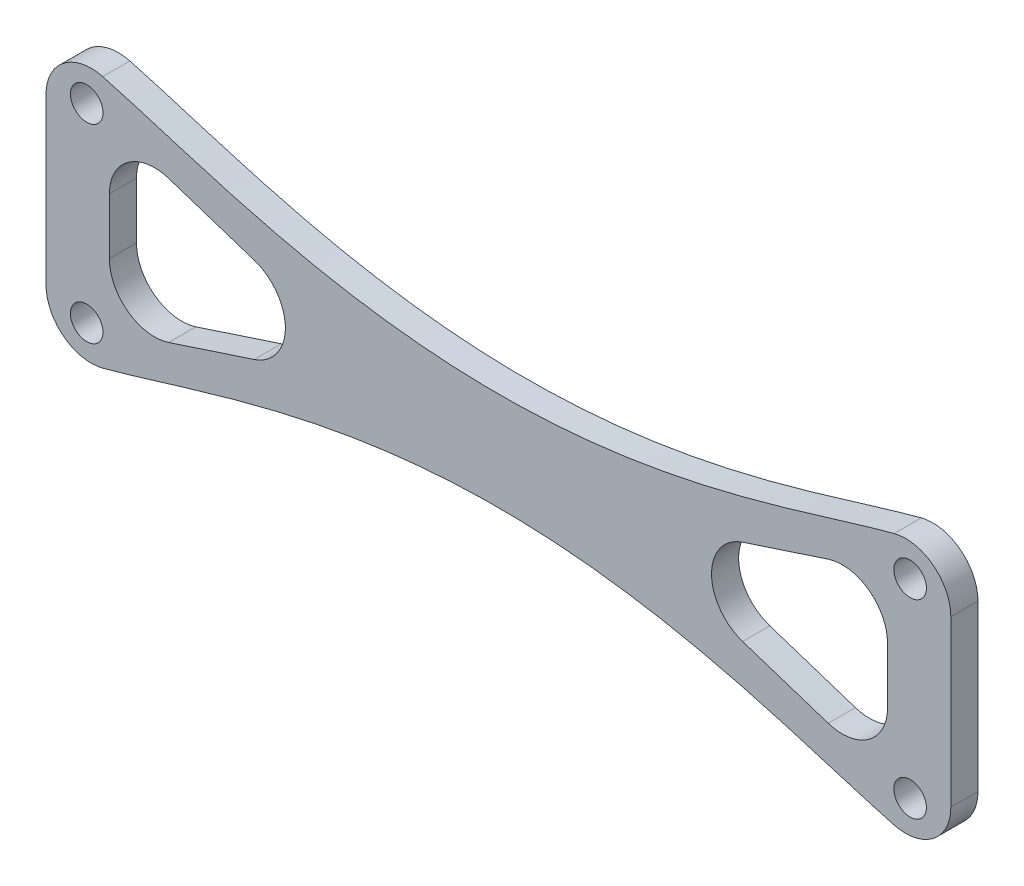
ISO-10303-21;
HEADER;
FILE_DESCRIPTION(('STEP AP214'),'2;1');
FILE_NAME('part.step','',(''),(''),'','','');
FILE_SCHEMA(('AUTOMOTIVE_DESIGN { 1 0 10303 214 1 1 1 1 }'));
ENDSEC;
DATA;
#1=APPLICATION_CONTEXT('core data for automotive mechanical design processes');
#2=APPLICATION_PROTOCOL_DEFINITION('international standard','automotive_design',2000,#1);
#3=PRODUCT_CONTEXT('',#1,'mechanical');
#4=PRODUCT('Part','Part','',(#3));
#5=PRODUCT_RELATED_PRODUCT_CATEGORY('part','',(#4));
#6=PRODUCT_DEFINITION_FORMATION('','',#4);
#7=PRODUCT_DEFINITION_CONTEXT('part definition',#1,'design');
#8=PRODUCT_DEFINITION('design','',#6,#7);
#9=PRODUCT_DEFINITION_SHAPE('','',#8);
#10=(LENGTH_UNIT() NAMED_UNIT(*) SI_UNIT(.MILLI.,.METRE.));
#11=(NAMED_UNIT(*) PLANE_ANGLE_UNIT() SI_UNIT($,.RADIAN.));
#12=(NAMED_UNIT(*) SI_UNIT($,.STERADIAN.) SOLID_ANGLE_UNIT());
#13=UNCERTAINTY_MEASURE_WITH_UNIT(LENGTH_MEASURE(1.E-05),#10,'distance_accuracy_value','');
#14=(GEOMETRIC_REPRESENTATION_CONTEXT(3) GLOBAL_UNCERTAINTY_ASSIGNED_CONTEXT((#13)) GLOBAL_UNIT_ASSIGNED_CONTEXT((#10,
#11,#12)) REPRESENTATION_CONTEXT('',''));
#15=CARTESIAN_POINT('',(0.,0.,0.));
#16=DIRECTION('',(0.,0.,1.));
#17=DIRECTION('',(1.,0.,0.));
#18=AXIS2_PLACEMENT_3D('',#15,#16,#17);
#19=CARTESIAN_POINT('',(-100.,0.,3.));
#20=DIRECTION('',(-1.,0.,0.));
#21=DIRECTION('',(0.,0.,1.));
#22=AXIS2_PLACEMENT_3D('',#19,#20,#21);
#23=PLANE('',#22);
#24=DIRECTION('',(0.,1.,0.));
#25=VECTOR('',#24,1.);
#26=CARTESIAN_POINT('',(-100.,0.,3.));
#27=LINE('',#26,#25);
#28=CARTESIAN_POINT('',(-100.,5.88603798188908,3.));
#29=VERTEX_POINT('',#28);
#30=CARTESIAN_POINT('',(-100.,24.1139620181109,3.));
#31=VERTEX_POINT('',#30);
#32=EDGE_CURVE('E417',#29,#31,#27,.T.);
#33=ORIENTED_EDGE('',*,*,#32,.T.);
#34=DIRECTION('',(0.,0.,-1.));
#35=VECTOR('',#34,1.);
#36=CARTESIAN_POINT('',(-100.,24.1139620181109,3.));
#37=LINE('',#36,#35);
#38=CARTESIAN_POINT('',(-100.,24.1139620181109,0.));
#39=VERTEX_POINT('',#38);
#40=EDGE_CURVE('E291',#31,#39,#37,.T.);
#41=ORIENTED_EDGE('',*,*,#40,.T.);
#42=DIRECTION('',(0.,1.,0.));
#43=VECTOR('',#42,1.);
#44=CARTESIAN_POINT('',(-100.,0.,0.));
#45=LINE('',#44,#43);
#46=CARTESIAN_POINT('',(-100.,5.88603798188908,0.));
#47=VERTEX_POINT('',#46);
#48=EDGE_CURVE('E221',#47,#39,#45,.T.);
#49=ORIENTED_EDGE('',*,*,#48,.F.);
#50=DIRECTION('',(0.,0.,1.));
#51=VECTOR('',#50,1.);
#52=CARTESIAN_POINT('',(-100.,5.88603798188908,3.));
#53=LINE('',#52,#51);
#54=EDGE_CURVE('E288',#47,#29,#53,.T.);
#55=ORIENTED_EDGE('',*,*,#54,.T.);
#56=EDGE_LOOP('',(#33,#41,#49,#55));
#57=FACE_BOUND('',#56,.T.);
#58=ADVANCED_FACE('F45',(#57),#23,.T.);
#59=CARTESIAN_POINT('',(-100.,0.,3.));
#60=CARTESIAN_POINT('',(-85.5,0.,3.));
#61=CARTESIAN_POINT('',(-50.,25.5,3.));
#62=CARTESIAN_POINT('',(-14.5,0.,3.));
#63=CARTESIAN_POINT('',(0.,0.,3.));
#64=B_SPLINE_CURVE_WITH_KNOTS('',4,(#59,#60,#61,#62,#63),.UNSPECIFIED.,.F.,.F.,(5,5),(0.,1.),.UNSPECIFIED.);
#65=DIRECTION('',(0.,0.,-1.));
#66=VECTOR('',#65,1.);
#67=SURFACE_OF_LINEAR_EXTRUSION('',#64,#66);
#68=CARTESIAN_POINT('',(-93.7291000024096,1.05025333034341,3.));
#69=VERTEX_POINT('',#68);
#70=CARTESIAN_POINT('',(-6.27089999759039,1.0502533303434,3.));
#71=VERTEX_POINT('',#70);
#72=EDGE_CURVE('E421',#69,#71,#64,.T.);
#73=ORIENTED_EDGE('',*,*,#72,.F.);
#74=DIRECTION('',(0.,0.,-1.));
#75=VECTOR('',#74,1.);
#76=CARTESIAN_POINT('',(-93.7291000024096,1.05025333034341,3.));
#77=LINE('',#76,#75);
#78=CARTESIAN_POINT('',(-93.7291000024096,1.05025333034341,0.));
#79=VERTEX_POINT('',#78);
#80=EDGE_CURVE('E328',#69,#79,#77,.T.);
#81=ORIENTED_EDGE('',*,*,#80,.T.);
#82=CARTESIAN_POINT('',(-100.,0.,0.));
#83=CARTESIAN_POINT('',(-85.5,0.,0.));
#84=CARTESIAN_POINT('',(-50.,25.5,0.));
#85=CARTESIAN_POINT('',(-14.5,0.,0.));
#86=CARTESIAN_POINT('',(0.,0.,0.));
#87=B_SPLINE_CURVE_WITH_KNOTS('',4,(#82,#83,#84,#85,#86),.UNSPECIFIED.,.F.,.F.,(5,5),(0.,1.),.UNSPECIFIED.);
#88=CARTESIAN_POINT('',(-6.27089999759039,1.0502533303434,0.));
#89=VERTEX_POINT('',#88);
#90=EDGE_CURVE('E230',#79,#89,#87,.T.);
#91=ORIENTED_EDGE('',*,*,#90,.T.);
#92=DIRECTION('',(0.,0.,-1.));
#93=VECTOR('',#92,1.);
#94=CARTESIAN_POINT('',(-6.27089999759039,1.0502533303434,0.));
#95=LINE('',#94,#93);
#96=EDGE_CURVE('E325',#89,#71,#95,.F.);
#97=ORIENTED_EDGE('',*,*,#96,.T.);
#98=EDGE_LOOP('',(#73,#81,#91,#97));
#99=FACE_BOUND('',#98,.T.);
#100=ADVANCED_FACE('F433',(#99),#67,.F.);
#101=CARTESIAN_POINT('',(0.,0.,3.));
#102=DIRECTION('',(-1.,0.,0.));
#103=DIRECTION('',(0.,0.,1.));
#104=AXIS2_PLACEMENT_3D('',#101,#102,#103);
#105=PLANE('',#104);
#106=DIRECTION('',(0.,1.,0.));
#107=VECTOR('',#106,1.);
#108=CARTESIAN_POINT('',(0.,0.,3.));
#109=LINE('',#108,#107);
#110=CARTESIAN_POINT('',(0.,5.88603798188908,3.));
#111=VERTEX_POINT('',#110);
#112=CARTESIAN_POINT('',(0.,24.1139620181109,3.));
#113=VERTEX_POINT('',#112);
#114=EDGE_CURVE('E427',#111,#113,#109,.T.);
#115=ORIENTED_EDGE('',*,*,#114,.F.);
#116=DIRECTION('',(0.,0.,-1.));
#117=VECTOR('',#116,1.);
#118=CARTESIAN_POINT('',(0.,5.88603798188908,3.));
#119=LINE('',#118,#117);
#120=CARTESIAN_POINT('',(0.,5.88603798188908,0.));
#121=VERTEX_POINT('',#120);
#122=EDGE_CURVE('E196',#111,#121,#119,.T.);
#123=ORIENTED_EDGE('',*,*,#122,.T.);
#124=DIRECTION('',(0.,1.,0.));
#125=VECTOR('',#124,1.);
#126=CARTESIAN_POINT('',(0.,0.,0.));
#127=LINE('',#126,#125);
#128=CARTESIAN_POINT('',(0.,24.1139620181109,0.));
#129=VERTEX_POINT('',#128);
#130=EDGE_CURVE('E236',#121,#129,#127,.T.);
#131=ORIENTED_EDGE('',*,*,#130,.T.);
#132=DIRECTION('',(0.,0.,1.));
#133=VECTOR('',#132,1.);
#134=CARTESIAN_POINT('',(0.,24.1139620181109,3.));
#135=LINE('',#134,#133);
#136=EDGE_CURVE('E61',#129,#113,#135,.T.);
#137=ORIENTED_EDGE('',*,*,#136,.T.);
#138=EDGE_LOOP('',(#115,#123,#131,#137));
#139=FACE_BOUND('',#138,.T.);
#140=ADVANCED_FACE('F437',(#139),#105,.F.);
#141=CARTESIAN_POINT('',(-7.,0.,3.));
#142=DIRECTION('',(1.,0.,0.));
#143=DIRECTION('',(0.,0.,-1.));
#144=AXIS2_PLACEMENT_3D('',#141,#142,#143);
#145=PLANE('',#144);
#146=DIRECTION('',(0.,-1.,0.));
#147=VECTOR('',#146,1.);
#148=CARTESIAN_POINT('',(-7.,0.,0.));
#149=LINE('',#148,#147);
#150=CARTESIAN_POINT('',(-7.,18.0987692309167,0.));
#151=VERTEX_POINT('',#150);
#152=CARTESIAN_POINT('',(-7.,11.9012307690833,0.));
#153=VERTEX_POINT('',#152);
#154=EDGE_CURVE('E216',#151,#153,#149,.T.);
#155=ORIENTED_EDGE('',*,*,#154,.T.);
#156=DIRECTION('',(0.,0.,-1.));
#157=VECTOR('',#156,1.);
#158=CARTESIAN_POINT('',(-7.,11.9012307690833,3.));
#159=LINE('',#158,#157);
#160=CARTESIAN_POINT('',(-7.,11.9012307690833,3.));
#161=VERTEX_POINT('',#160);
#162=EDGE_CURVE('E189',#153,#161,#159,.F.);
#163=ORIENTED_EDGE('',*,*,#162,.T.);
#164=DIRECTION('',(0.,-1.,0.));
#165=VECTOR('',#164,1.);
#166=CARTESIAN_POINT('',(-7.,0.,3.));
#167=LINE('',#166,#165);
#168=CARTESIAN_POINT('',(-7.,18.0987692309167,3.));
#169=VERTEX_POINT('',#168);
#170=EDGE_CURVE('E407',#169,#161,#167,.T.);
#171=ORIENTED_EDGE('',*,*,#170,.F.);
#172=DIRECTION('',(0.,0.,-1.));
#173=VECTOR('',#172,1.);
#174=CARTESIAN_POINT('',(-7.,18.0987692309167,0.));
#175=LINE('',#174,#173);
#176=EDGE_CURVE('E207',#169,#151,#175,.T.);
#177=ORIENTED_EDGE('',*,*,#176,.T.);
#178=EDGE_LOOP('',(#155,#163,#171,#177));
#179=FACE_BOUND('',#178,.T.);
#180=ADVANCED_FACE('F450',(#179),#145,.F.);
#181=CARTESIAN_POINT('',(0.80077651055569,2.44236835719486,3.));
#182=DIRECTION('',(-0.311550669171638,-0.950229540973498,0.));
#183=DIRECTION('',(0.950229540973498,-0.311550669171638,0.));
#184=AXIS2_PLACEMENT_3D('',#181,#182,#183);
#185=PLANE('',#184);
#186=DIRECTION('',(-0.950229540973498,0.311550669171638,0.));
#187=VECTOR('',#186,1.);
#188=CARTESIAN_POINT('',(0.80077651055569,2.44236835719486,3.));
#189=LINE('',#188,#187);
#190=CARTESIAN_POINT('',(-13.5577533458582,7.1500830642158,3.));
#191=VERTEX_POINT('',#190);
#192=CARTESIAN_POINT('',(-23.0089995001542,10.2488522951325,3.));
#193=VERTEX_POINT('',#192);
#194=EDGE_CURVE('E205',#191,#193,#189,.T.);
#195=ORIENTED_EDGE('',*,*,#194,.F.);
#196=DIRECTION('',(0.,0.,-1.));
#197=VECTOR('',#196,1.);
#198=CARTESIAN_POINT('',(-13.5577533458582,7.1500830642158,0.));
#199=LINE('',#198,#197);
#200=CARTESIAN_POINT('',(-13.5577533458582,7.1500830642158,0.));
#201=VERTEX_POINT('',#200);
#202=EDGE_CURVE('E188',#191,#201,#199,.T.);
#203=ORIENTED_EDGE('',*,*,#202,.T.);
#204=DIRECTION('',(-0.950229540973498,0.311550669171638,0.));
#205=VECTOR('',#204,1.);
#206=CARTESIAN_POINT('',(0.80077651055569,2.44236835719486,0.));
#207=LINE('',#206,#205);
#208=CARTESIAN_POINT('',(-23.0089995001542,10.2488522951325,0.));
#209=VERTEX_POINT('',#208);
#210=EDGE_CURVE('E202',#201,#209,#207,.T.);
#211=ORIENTED_EDGE('',*,*,#210,.T.);
#212=DIRECTION('',(0.,0.,-1.));
#213=VECTOR('',#212,1.);
#214=CARTESIAN_POINT('',(-23.0089995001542,10.2488522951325,3.));
#215=LINE('',#214,#213);
#216=EDGE_CURVE('E208',#209,#193,#215,.F.);
#217=ORIENTED_EDGE('',*,*,#216,.T.);
#218=EDGE_LOOP('',(#195,#203,#211,#217));
#219=FACE_BOUND('',#218,.T.);
#220=ADVANCED_FACE('F201',(#219),#185,.F.);
#221=CARTESIAN_POINT('',(-1.6258189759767,-4.95874787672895,3.));
#222=DIRECTION('',(-0.311550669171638,-0.950229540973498,0.));
#223=DIRECTION('',(0.950229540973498,-0.311550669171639,0.));
#224=AXIS2_PLACEMENT_3D('',#221,#222,#223);
#225=PLANE('',#224);
#226=DIRECTION('',(-0.950229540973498,0.311550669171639,0.));
#227=VECTOR('',#226,1.);
#228=CARTESIAN_POINT('',(-1.6258189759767,-4.95874787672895,0.));
#229=LINE('',#228,#227);
#230=CARTESIAN_POINT('',(-76.9910004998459,19.7511477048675,0.));
#231=VERTEX_POINT('',#230);
#232=CARTESIAN_POINT('',(-86.4422466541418,22.8499169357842,0.));
#233=VERTEX_POINT('',#232);
#234=EDGE_CURVE('E368',#231,#233,#229,.T.);
#235=ORIENTED_EDGE('',*,*,#234,.F.);
#236=DIRECTION('',(0.,0.,-1.));
#237=VECTOR('',#236,1.);
#238=CARTESIAN_POINT('',(-76.9910004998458,19.7511477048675,3.));
#239=LINE('',#238,#237);
#240=CARTESIAN_POINT('',(-76.9910004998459,19.7511477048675,3.));
#241=VERTEX_POINT('',#240);
#242=EDGE_CURVE('E278',#231,#241,#239,.F.);
#243=ORIENTED_EDGE('',*,*,#242,.T.);
#244=DIRECTION('',(-0.950229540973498,0.311550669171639,0.));
#245=VECTOR('',#244,1.);
#246=CARTESIAN_POINT('',(-1.6258189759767,-4.95874787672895,3.));
#247=LINE('',#246,#245);
#248=CARTESIAN_POINT('',(-86.4422466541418,22.8499169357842,3.));
#249=VERTEX_POINT('',#248);
#250=EDGE_CURVE('E386',#241,#249,#247,.T.);
#251=ORIENTED_EDGE('',*,*,#250,.T.);
#252=DIRECTION('',(0.,0.,-1.));
#253=VECTOR('',#252,1.);
#254=CARTESIAN_POINT('',(-86.4422466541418,22.8499169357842,0.));
#255=LINE('',#254,#253);
#256=EDGE_CURVE('E274',#249,#233,#255,.T.);
#257=ORIENTED_EDGE('',*,*,#256,.T.);
#258=EDGE_LOOP('',(#235,#243,#251,#257));
#259=FACE_BOUND('',#258,.T.);
#260=ADVANCED_FACE('F390',(#259),#225,.T.);
#261=CARTESIAN_POINT('',(-10.5071584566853,32.0468332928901,3.));
#262=DIRECTION('',(-0.311550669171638,0.950229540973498,0.));
#263=DIRECTION('',(-0.950229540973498,-0.311550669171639,0.));
#264=AXIS2_PLACEMENT_3D('',#261,#262,#263);
#265=PLANE('',#264);
#266=DIRECTION('',(0.950229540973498,0.311550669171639,0.));
#267=VECTOR('',#266,1.);
#268=CARTESIAN_POINT('',(-10.5071584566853,32.0468332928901,3.));
#269=LINE('',#268,#267);
#270=CARTESIAN_POINT('',(-86.4422466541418,7.1500830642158,3.));
#271=VERTEX_POINT('',#270);
#272=CARTESIAN_POINT('',(-76.9910004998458,10.2488522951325,3.));
#273=VERTEX_POINT('',#272);
#274=EDGE_CURVE('E393',#271,#273,#269,.T.);
#275=ORIENTED_EDGE('',*,*,#274,.T.);
#276=DIRECTION('',(0.,0.,-1.));
#277=VECTOR('',#276,1.);
#278=CARTESIAN_POINT('',(-76.9910004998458,10.2488522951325,0.));
#279=LINE('',#278,#277);
#280=CARTESIAN_POINT('',(-76.9910004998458,10.2488522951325,0.));
#281=VERTEX_POINT('',#280);
#282=EDGE_CURVE('E270',#273,#281,#279,.T.);
#283=ORIENTED_EDGE('',*,*,#282,.T.);
#284=DIRECTION('',(0.950229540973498,0.311550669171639,0.));
#285=VECTOR('',#284,1.);
#286=CARTESIAN_POINT('',(-10.5071584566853,32.0468332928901,0.));
#287=LINE('',#286,#285);
#288=CARTESIAN_POINT('',(-86.4422466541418,7.1500830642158,0.));
#289=VERTEX_POINT('',#288);
#290=EDGE_CURVE('E378',#289,#281,#287,.T.);
#291=ORIENTED_EDGE('',*,*,#290,.F.);
#292=DIRECTION('',(0.,0.,-1.));
#293=VECTOR('',#292,1.);
#294=CARTESIAN_POINT('',(-86.4422466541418,7.1500830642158,3.));
#295=LINE('',#294,#293);
#296=EDGE_CURVE('E267',#289,#271,#295,.F.);
#297=ORIENTED_EDGE('',*,*,#296,.T.);
#298=EDGE_LOOP('',(#275,#283,#291,#297));
#299=FACE_BOUND('',#298,.T.);
#300=ADVANCED_FACE('F446',(#299),#265,.T.);
#301=CARTESIAN_POINT('',(-8.08056297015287,24.6457170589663,3.));
#302=DIRECTION('',(-0.311550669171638,0.950229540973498,0.));
#303=DIRECTION('',(-0.950229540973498,-0.311550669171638,0.));
#304=AXIS2_PLACEMENT_3D('',#301,#302,#303);
#305=PLANE('',#304);
#306=DIRECTION('',(0.950229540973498,0.311550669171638,0.));
#307=VECTOR('',#306,1.);
#308=CARTESIAN_POINT('',(-8.08056297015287,24.6457170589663,0.));
#309=LINE('',#308,#307);
#310=CARTESIAN_POINT('',(-23.0089995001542,19.7511477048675,0.));
#311=VERTEX_POINT('',#310);
#312=CARTESIAN_POINT('',(-13.5577533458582,22.8499169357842,0.));
#313=VERTEX_POINT('',#312);
#314=EDGE_CURVE('E215',#311,#313,#309,.T.);
#315=ORIENTED_EDGE('',*,*,#314,.T.);
#316=DIRECTION('',(0.,0.,-1.));
#317=VECTOR('',#316,1.);
#318=CARTESIAN_POINT('',(-13.5577533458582,22.8499169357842,3.));
#319=LINE('',#318,#317);
#320=CARTESIAN_POINT('',(-13.5577533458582,22.8499169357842,3.));
#321=VERTEX_POINT('',#320);
#322=EDGE_CURVE('E264',#313,#321,#319,.F.);
#323=ORIENTED_EDGE('',*,*,#322,.T.);
#324=DIRECTION('',(0.950229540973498,0.311550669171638,0.));
#325=VECTOR('',#324,1.);
#326=CARTESIAN_POINT('',(-8.08056297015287,24.6457170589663,3.));
#327=LINE('',#326,#325);
#328=CARTESIAN_POINT('',(-23.0089995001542,19.7511477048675,3.));
#329=VERTEX_POINT('',#328);
#330=EDGE_CURVE('E413',#329,#321,#327,.T.);
#331=ORIENTED_EDGE('',*,*,#330,.F.);
#332=DIRECTION('',(0.,0.,-1.));
#333=VECTOR('',#332,1.);
#334=CARTESIAN_POINT('',(-23.0089995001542,19.7511477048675,0.));
#335=LINE('',#334,#333);
#336=EDGE_CURVE('E260',#329,#311,#335,.T.);
#337=ORIENTED_EDGE('',*,*,#336,.T.);
#338=EDGE_LOOP('',(#315,#323,#331,#337));
#339=FACE_BOUND('',#338,.T.);
#340=ADVANCED_FACE('F443',(#339),#305,.F.);
#341=CARTESIAN_POINT('',(-93.,0.,3.));
#342=DIRECTION('',(1.,0.,0.));
#343=DIRECTION('',(0.,0.,-1.));
#344=AXIS2_PLACEMENT_3D('',#341,#342,#343);
#345=PLANE('',#344);
#346=DIRECTION('',(0.,-1.,0.));
#347=VECTOR('',#346,1.);
#348=CARTESIAN_POINT('',(-93.,0.,3.));
#349=LINE('',#348,#347);
#350=CARTESIAN_POINT('',(-93.,18.0987692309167,3.));
#351=VERTEX_POINT('',#350);
#352=CARTESIAN_POINT('',(-93.,11.9012307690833,3.));
#353=VERTEX_POINT('',#352);
#354=EDGE_CURVE('E388',#351,#353,#349,.T.);
#355=ORIENTED_EDGE('',*,*,#354,.T.);
#356=DIRECTION('',(0.,0.,-1.));
#357=VECTOR('',#356,1.);
#358=CARTESIAN_POINT('',(-93.,11.9012307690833,0.));
#359=LINE('',#358,#357);
#360=CARTESIAN_POINT('',(-93.,11.9012307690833,0.));
#361=VERTEX_POINT('',#360);
#362=EDGE_CURVE('E284',#353,#361,#359,.T.);
#363=ORIENTED_EDGE('',*,*,#362,.T.);
#364=DIRECTION('',(0.,-1.,0.));
#365=VECTOR('',#364,1.);
#366=CARTESIAN_POINT('',(-93.,0.,0.));
#367=LINE('',#366,#365);
#368=CARTESIAN_POINT('',(-93.,18.0987692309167,0.));
#369=VERTEX_POINT('',#368);
#370=EDGE_CURVE('E223',#369,#361,#367,.T.);
#371=ORIENTED_EDGE('',*,*,#370,.F.);
#372=DIRECTION('',(0.,0.,-1.));
#373=VECTOR('',#372,1.);
#374=CARTESIAN_POINT('',(-93.,18.0987692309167,3.));
#375=LINE('',#374,#373);
#376=EDGE_CURVE('E281',#369,#351,#375,.F.);
#377=ORIENTED_EDGE('',*,*,#376,.T.);
#378=EDGE_LOOP('',(#355,#363,#371,#377));
#379=FACE_BOUND('',#378,.T.);
#380=ADVANCED_FACE('F374',(#379),#345,.T.);
#381=CARTESIAN_POINT('',(-4.5,25.5,3.));
#382=DIRECTION('',(0.,0.,-1.));
#383=DIRECTION('',(-1.,0.,0.));
#384=AXIS2_PLACEMENT_3D('',#381,#382,#383);
#385=CYLINDRICAL_SURFACE('',#384,1.8);
#386=CARTESIAN_POINT('',(-4.5,25.5,3.));
#387=DIRECTION('',(0.,0.,1.));
#388=DIRECTION('',(1.,0.,0.));
#389=AXIS2_PLACEMENT_3D('',#386,#387,#388);
#390=CIRCLE('',#389,1.8);
#391=CARTESIAN_POINT('',(-2.7,25.5,3.));
#392=VERTEX_POINT('',#391);
#393=EDGE_CURVE('E394',#392,#392,#390,.T.);
#394=ORIENTED_EDGE('',*,*,#393,.T.);
#395=EDGE_LOOP('',(#394));
#396=FACE_BOUND('',#395,.T.);
#397=CARTESIAN_POINT('',(-4.5,25.5,0.));
#398=DIRECTION('',(0.,0.,1.));
#399=DIRECTION('',(1.,0.,0.));
#400=AXIS2_PLACEMENT_3D('',#397,#398,#399);
#401=CIRCLE('',#400,1.8);
#402=CARTESIAN_POINT('',(-2.7,25.5,0.));
#403=VERTEX_POINT('',#402);
#404=EDGE_CURVE('E558',#403,#403,#401,.T.);
#405=ORIENTED_EDGE('',*,*,#404,.F.);
#406=EDGE_LOOP('',(#405));
#407=FACE_BOUND('',#406,.T.);
#408=ADVANCED_FACE('F456',(#396,#407),#385,.F.);
#409=CARTESIAN_POINT('',(-4.5,4.5,3.));
#410=DIRECTION('',(0.,0.,-1.));
#411=DIRECTION('',(-1.,0.,0.));
#412=AXIS2_PLACEMENT_3D('',#409,#410,#411);
#413=CYLINDRICAL_SURFACE('',#412,1.8);
#414=CARTESIAN_POINT('',(-4.5,4.5,3.));
#415=DIRECTION('',(0.,0.,1.));
#416=DIRECTION('',(1.,0.,0.));
#417=AXIS2_PLACEMENT_3D('',#414,#415,#416);
#418=CIRCLE('',#417,1.8);
#419=CARTESIAN_POINT('',(-2.7,4.5,3.));
#420=VERTEX_POINT('',#419);
#421=EDGE_CURVE('E401',#420,#420,#418,.T.);
#422=ORIENTED_EDGE('',*,*,#421,.T.);
#423=EDGE_LOOP('',(#422));
#424=FACE_BOUND('',#423,.T.);
#425=CARTESIAN_POINT('',(-4.5,4.5,0.));
#426=DIRECTION('',(0.,0.,1.));
#427=DIRECTION('',(1.,0.,0.));
#428=AXIS2_PLACEMENT_3D('',#425,#426,#427);
#429=CIRCLE('',#428,1.8);
#430=CARTESIAN_POINT('',(-2.7,4.5,0.));
#431=VERTEX_POINT('',#430);
#432=EDGE_CURVE('E561',#431,#431,#429,.T.);
#433=ORIENTED_EDGE('',*,*,#432,.F.);
#434=EDGE_LOOP('',(#433));
#435=FACE_BOUND('',#434,.T.);
#436=ADVANCED_FACE('F464',(#424,#435),#413,.F.);
#437=CARTESIAN_POINT('',(-95.5,25.5,3.));
#438=DIRECTION('',(0.,0.,-1.));
#439=DIRECTION('',(-1.,0.,0.));
#440=AXIS2_PLACEMENT_3D('',#437,#438,#439);
#441=CYLINDRICAL_SURFACE('',#440,1.79999999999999);
#442=CARTESIAN_POINT('',(-95.5,25.5,3.));
#443=DIRECTION('',(0.,0.,1.));
#444=DIRECTION('',(1.,0.,0.));
#445=AXIS2_PLACEMENT_3D('',#442,#443,#444);
#446=CIRCLE('',#445,1.79999999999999);
#447=CARTESIAN_POINT('',(-93.7,25.5,3.));
#448=VERTEX_POINT('',#447);
#449=EDGE_CURVE('E550',#448,#448,#446,.T.);
#450=ORIENTED_EDGE('',*,*,#449,.T.);
#451=EDGE_LOOP('',(#450));
#452=FACE_BOUND('',#451,.T.);
#453=CARTESIAN_POINT('',(-95.5,25.5,0.));
#454=DIRECTION('',(0.,0.,1.));
#455=DIRECTION('',(1.,0.,0.));
#456=AXIS2_PLACEMENT_3D('',#453,#454,#455);
#457=CIRCLE('',#456,1.79999999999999);
#458=CARTESIAN_POINT('',(-93.7,25.5,0.));
#459=VERTEX_POINT('',#458);
#460=EDGE_CURVE('E567',#459,#459,#457,.T.);
#461=ORIENTED_EDGE('',*,*,#460,.F.);
#462=EDGE_LOOP('',(#461));
#463=FACE_BOUND('',#462,.T.);
#464=ADVANCED_FACE('F468',(#452,#463),#441,.F.);
#465=CARTESIAN_POINT('',(-95.5,4.5,3.));
#466=DIRECTION('',(0.,0.,-1.));
#467=DIRECTION('',(-1.,0.,0.));
#468=AXIS2_PLACEMENT_3D('',#465,#466,#467);
#469=CYLINDRICAL_SURFACE('',#468,1.79999999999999);
#470=CARTESIAN_POINT('',(-95.5,4.5,3.));
#471=DIRECTION('',(0.,0.,1.));
#472=DIRECTION('',(1.,0.,0.));
#473=AXIS2_PLACEMENT_3D('',#470,#471,#472);
#474=CIRCLE('',#473,1.79999999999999);
#475=CARTESIAN_POINT('',(-93.7,4.5,3.));
#476=VERTEX_POINT('',#475);
#477=EDGE_CURVE('E248',#476,#476,#474,.T.);
#478=ORIENTED_EDGE('',*,*,#477,.T.);
#479=EDGE_LOOP('',(#478));
#480=FACE_BOUND('',#479,.T.);
#481=CARTESIAN_POINT('',(-95.5,4.5,0.));
#482=DIRECTION('',(0.,0.,1.));
#483=DIRECTION('',(1.,0.,0.));
#484=AXIS2_PLACEMENT_3D('',#481,#482,#483);
#485=CIRCLE('',#484,1.79999999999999);
#486=CARTESIAN_POINT('',(-93.7,4.5,0.));
#487=VERTEX_POINT('',#486);
#488=EDGE_CURVE('E530',#487,#487,#485,.T.);
#489=ORIENTED_EDGE('',*,*,#488,.F.);
#490=EDGE_LOOP('',(#489));
#491=FACE_BOUND('',#490,.T.);
#492=ADVANCED_FACE('F472',(#480,#491),#469,.F.);
#493=CARTESIAN_POINT('',(-100.,30.,3.));
#494=CARTESIAN_POINT('',(-85.5,30.,3.));
#495=CARTESIAN_POINT('',(-50.,4.5,3.));
#496=CARTESIAN_POINT('',(-14.5,30.,3.));
#497=CARTESIAN_POINT('',(0.,30.,3.));
#498=B_SPLINE_CURVE_WITH_KNOTS('',4,(#493,#494,#495,#496,#497),.UNSPECIFIED.,.F.,.F.,(5,5),(0.,
1.),.UNSPECIFIED.);
#499=DIRECTION('',(0.,0.,-1.));
#500=VECTOR('',#499,1.);
#501=SURFACE_OF_LINEAR_EXTRUSION('',#498,#500);
#502=CARTESIAN_POINT('',(-100.,30.,0.));
#503=CARTESIAN_POINT('',(-85.5,30.,0.));
#504=CARTESIAN_POINT('',(-50.,4.5,0.));
#505=CARTESIAN_POINT('',(-14.5,30.,0.));
#506=CARTESIAN_POINT('',(0.,30.,0.));
#507=B_SPLINE_CURVE_WITH_KNOTS('',4,(#502,#503,#504,#505,#506),.UNSPECIFIED.,.F.,.F.,(5,5),(0.,
1.),.UNSPECIFIED.);
#508=CARTESIAN_POINT('',(-93.7291000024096,28.9497466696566,0.));
#509=VERTEX_POINT('',#508);
#510=CARTESIAN_POINT('',(-6.27089999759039,28.9497466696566,0.));
#511=VERTEX_POINT('',#510);
#512=EDGE_CURVE('E242',#509,#511,#507,.T.);
#513=ORIENTED_EDGE('',*,*,#512,.F.);
#514=DIRECTION('',(0.,0.,-1.));
#515=VECTOR('',#514,1.);
#516=CARTESIAN_POINT('',(-93.7291000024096,28.9497466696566,0.));
#517=LINE('',#516,#515);
#518=CARTESIAN_POINT('',(-93.7291000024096,28.9497466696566,3.));
#519=VERTEX_POINT('',#518);
#520=EDGE_CURVE('E311',#509,#519,#517,.F.);
#521=ORIENTED_EDGE('',*,*,#520,.T.);
#522=CARTESIAN_POINT('',(-6.27089999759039,28.9497466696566,3.));
#523=VERTEX_POINT('',#522);
#524=EDGE_CURVE('E253',#519,#523,#498,.T.);
#525=ORIENTED_EDGE('',*,*,#524,.T.);
#526=DIRECTION('',(0.,0.,-1.));
#527=VECTOR('',#526,1.);
#528=CARTESIAN_POINT('',(-6.27089999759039,28.9497466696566,3.));
#529=LINE('',#528,#527);
#530=EDGE_CURVE('E307',#523,#511,#529,.T.);
#531=ORIENTED_EDGE('',*,*,#530,.T.);
#532=EDGE_LOOP('',(#513,#521,#525,#531));
#533=FACE_BOUND('',#532,.T.);
#534=ADVANCED_FACE('F476',(#533),#501,.T.);
#535=CARTESIAN_POINT('',(0.,0.,3.));
#536=DIRECTION('',(0.,0.,1.));
#537=DIRECTION('',(1.,0.,0.));
#538=AXIS2_PLACEMENT_3D('',#535,#536,#537);
#539=PLANE('',#538);
#540=ORIENTED_EDGE('',*,*,#477,.F.);
#541=EDGE_LOOP('',(#540));
#542=FACE_BOUND('',#541,.T.);
#543=ORIENTED_EDGE('',*,*,#449,.F.);
#544=EDGE_LOOP('',(#543));
#545=FACE_BOUND('',#544,.T.);
#546=ORIENTED_EDGE('',*,*,#421,.F.);
#547=EDGE_LOOP('',(#546));
#548=FACE_BOUND('',#547,.T.);
#549=ORIENTED_EDGE('',*,*,#393,.F.);
#550=EDGE_LOOP('',(#549));
#551=FACE_BOUND('',#550,.T.);
#552=ORIENTED_EDGE('',*,*,#250,.F.);
#553=CARTESIAN_POINT('',(-78.548753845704,15.,3.));
#554=DIRECTION('',(0.,0.,1.));
#555=DIRECTION('',(1.,0.,0.));
#556=AXIS2_PLACEMENT_3D('',#553,#554,#555);
#557=CIRCLE('',#556,5.);
#558=EDGE_CURVE('E353',#241,#273,#557,.F.);
#559=ORIENTED_EDGE('',*,*,#558,.T.);
#560=ORIENTED_EDGE('',*,*,#274,.F.);
#561=CARTESIAN_POINT('',(-88.,11.9012307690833,3.));
#562=DIRECTION('',(0.,0.,1.));
#563=DIRECTION('',(1.,0.,0.));
#564=AXIS2_PLACEMENT_3D('',#561,#562,#563);
#565=CIRCLE('',#564,5.);
#566=EDGE_CURVE('E359',#271,#353,#565,.F.);
#567=ORIENTED_EDGE('',*,*,#566,.T.);
#568=ORIENTED_EDGE('',*,*,#354,.F.);
#569=CARTESIAN_POINT('',(-88.,18.0987692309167,3.));
#570=DIRECTION('',(0.,0.,1.));
#571=DIRECTION('',(1.,0.,0.));
#572=AXIS2_PLACEMENT_3D('',#569,#570,#571);
#573=CIRCLE('',#572,5.);
#574=EDGE_CURVE('E11',#351,#249,#573,.F.);
#575=ORIENTED_EDGE('',*,*,#574,.T.);
#576=EDGE_LOOP('',(#552,#559,#560,#567,#568,#575));
#577=FACE_BOUND('',#576,.T.);
#578=ORIENTED_EDGE('',*,*,#330,.T.);
#579=CARTESIAN_POINT('',(-12.,18.0987692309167,3.));
#580=DIRECTION('',(0.,0.,1.));
#581=DIRECTION('',(1.,0.,0.));
#582=AXIS2_PLACEMENT_3D('',#579,#580,#581);
#583=CIRCLE('',#582,5.);
#584=EDGE_CURVE('E342',#321,#169,#583,.F.);
#585=ORIENTED_EDGE('',*,*,#584,.T.);
#586=ORIENTED_EDGE('',*,*,#170,.T.);
#587=CARTESIAN_POINT('',(-12.,11.9012307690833,3.));
#588=DIRECTION('',(0.,0.,1.));
#589=DIRECTION('',(1.,0.,0.));
#590=AXIS2_PLACEMENT_3D('',#587,#588,#589);
#591=CIRCLE('',#590,5.);
#592=EDGE_CURVE('E195',#161,#191,#591,.F.);
#593=ORIENTED_EDGE('',*,*,#592,.T.);
#594=ORIENTED_EDGE('',*,*,#194,.T.);
#595=CARTESIAN_POINT('',(-21.451246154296,15.,3.));
#596=DIRECTION('',(0.,0.,1.));
#597=DIRECTION('',(1.,0.,0.));
#598=AXIS2_PLACEMENT_3D('',#595,#596,#597);
#599=CIRCLE('',#598,5.);
#600=EDGE_CURVE('E347',#193,#329,#599,.F.);
#601=ORIENTED_EDGE('',*,*,#600,.T.);
#602=EDGE_LOOP('',(#578,#585,#586,#593,#594,#601));
#603=FACE_BOUND('',#602,.T.);
#604=ORIENTED_EDGE('',*,*,#524,.F.);
#605=CARTESIAN_POINT('',(-95.,24.1139620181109,3.));
#606=DIRECTION('',(0.,0.,1.));
#607=DIRECTION('',(1.,0.,0.));
#608=AXIS2_PLACEMENT_3D('',#605,#606,#607);
#609=CIRCLE('',#608,5.);
#610=EDGE_CURVE('E322',#519,#31,#609,.T.);
#611=ORIENTED_EDGE('',*,*,#610,.T.);
#612=ORIENTED_EDGE('',*,*,#32,.F.);
#613=CARTESIAN_POINT('',(-95.,5.88603798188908,3.));
#614=DIRECTION('',(0.,0.,1.));
#615=DIRECTION('',(1.,0.,0.));
#616=AXIS2_PLACEMENT_3D('',#613,#614,#615);
#617=CIRCLE('',#616,5.);
#618=EDGE_CURVE('E319',#29,#69,#617,.T.);
#619=ORIENTED_EDGE('',*,*,#618,.T.);
#620=ORIENTED_EDGE('',*,*,#72,.T.);
#621=CARTESIAN_POINT('',(-5.,5.88603798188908,3.));
#622=DIRECTION('',(0.,0.,1.));
#623=DIRECTION('',(1.,0.,0.));
#624=AXIS2_PLACEMENT_3D('',#621,#622,#623);
#625=CIRCLE('',#624,5.);
#626=EDGE_CURVE('E68',#71,#111,#625,.T.);
#627=ORIENTED_EDGE('',*,*,#626,.T.);
#628=ORIENTED_EDGE('',*,*,#114,.T.);
#629=CARTESIAN_POINT('',(-5.,24.1139620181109,3.));
#630=DIRECTION('',(0.,0.,1.));
#631=DIRECTION('',(1.,0.,0.));
#632=AXIS2_PLACEMENT_3D('',#629,#630,#631);
#633=CIRCLE('',#632,5.);
#634=EDGE_CURVE('E314',#113,#523,#633,.T.);
#635=ORIENTED_EDGE('',*,*,#634,.T.);
#636=EDGE_LOOP('',(#604,#611,#612,#619,#620,#627,#628,#635));
#637=FACE_BOUND('',#636,.T.);
#638=ADVANCED_FACE('F384',(#542,#545,#548,#551,#577,#603,#637),#539,.T.);
#639=CARTESIAN_POINT('',(0.,0.,0.));
#640=DIRECTION('',(0.,0.,1.));
#641=DIRECTION('',(1.,0.,0.));
#642=AXIS2_PLACEMENT_3D('',#639,#640,#641);
#643=PLANE('',#642);
#644=ORIENTED_EDGE('',*,*,#488,.T.);
#645=EDGE_LOOP('',(#644));
#646=FACE_BOUND('',#645,.T.);
#647=ORIENTED_EDGE('',*,*,#460,.T.);
#648=EDGE_LOOP('',(#647));
#649=FACE_BOUND('',#648,.T.);
#650=ORIENTED_EDGE('',*,*,#432,.T.);
#651=EDGE_LOOP('',(#650));
#652=FACE_BOUND('',#651,.T.);
#653=ORIENTED_EDGE('',*,*,#404,.T.);
#654=EDGE_LOOP('',(#653));
#655=FACE_BOUND('',#654,.T.);
#656=ORIENTED_EDGE('',*,*,#290,.T.);
#657=CARTESIAN_POINT('',(-78.548753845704,15.,0.));
#658=DIRECTION('',(0.,0.,1.));
#659=DIRECTION('',(1.,0.,0.));
#660=AXIS2_PLACEMENT_3D('',#657,#658,#659);
#661=CIRCLE('',#660,5.);
#662=EDGE_CURVE('E350',#281,#231,#661,.T.);
#663=ORIENTED_EDGE('',*,*,#662,.T.);
#664=ORIENTED_EDGE('',*,*,#234,.T.);
#665=CARTESIAN_POINT('',(-88.,18.0987692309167,0.));
#666=DIRECTION('',(0.,0.,1.));
#667=DIRECTION('',(1.,0.,0.));
#668=AXIS2_PLACEMENT_3D('',#665,#666,#667);
#669=CIRCLE('',#668,5.);
#670=EDGE_CURVE('E54',#233,#369,#669,.T.);
#671=ORIENTED_EDGE('',*,*,#670,.T.);
#672=ORIENTED_EDGE('',*,*,#370,.T.);
#673=CARTESIAN_POINT('',(-88.,11.9012307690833,0.));
#674=DIRECTION('',(0.,0.,1.));
#675=DIRECTION('',(1.,0.,0.));
#676=AXIS2_PLACEMENT_3D('',#673,#674,#675);
#677=CIRCLE('',#676,5.);
#678=EDGE_CURVE('E356',#361,#289,#677,.T.);
#679=ORIENTED_EDGE('',*,*,#678,.T.);
#680=EDGE_LOOP('',(#656,#663,#664,#671,#672,#679));
#681=FACE_BOUND('',#680,.T.);
#682=ORIENTED_EDGE('',*,*,#154,.F.);
#683=CARTESIAN_POINT('',(-12.,18.0987692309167,0.));
#684=DIRECTION('',(0.,0.,1.));
#685=DIRECTION('',(1.,0.,0.));
#686=AXIS2_PLACEMENT_3D('',#683,#684,#685);
#687=CIRCLE('',#686,5.);
#688=EDGE_CURVE('E339',#151,#313,#687,.T.);
#689=ORIENTED_EDGE('',*,*,#688,.T.);
#690=ORIENTED_EDGE('',*,*,#314,.F.);
#691=CARTESIAN_POINT('',(-21.451246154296,15.,0.));
#692=DIRECTION('',(0.,0.,1.));
#693=DIRECTION('',(1.,0.,0.));
#694=AXIS2_PLACEMENT_3D('',#691,#692,#693);
#695=CIRCLE('',#694,5.);
#696=EDGE_CURVE('E213',#311,#209,#695,.T.);
#697=ORIENTED_EDGE('',*,*,#696,.T.);
#698=ORIENTED_EDGE('',*,*,#210,.F.);
#699=CARTESIAN_POINT('',(-12.,11.9012307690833,0.));
#700=DIRECTION('',(0.,0.,1.));
#701=DIRECTION('',(1.,0.,0.));
#702=AXIS2_PLACEMENT_3D('',#699,#700,#701);
#703=CIRCLE('',#702,5.);
#704=EDGE_CURVE('E184',#201,#153,#703,.T.);
#705=ORIENTED_EDGE('',*,*,#704,.T.);
#706=EDGE_LOOP('',(#682,#689,#690,#697,#698,#705));
#707=FACE_BOUND('',#706,.T.);
#708=ORIENTED_EDGE('',*,*,#48,.T.);
#709=CARTESIAN_POINT('',(-95.,24.1139620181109,0.));
#710=DIRECTION('',(0.,0.,1.));
#711=DIRECTION('',(1.,0.,0.));
#712=AXIS2_PLACEMENT_3D('',#709,#710,#711);
#713=CIRCLE('',#712,5.);
#714=EDGE_CURVE('E304',#39,#509,#713,.F.);
#715=ORIENTED_EDGE('',*,*,#714,.T.);
#716=ORIENTED_EDGE('',*,*,#512,.T.);
#717=CARTESIAN_POINT('',(-5.,24.1139620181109,0.));
#718=DIRECTION('',(0.,0.,1.));
#719=DIRECTION('',(1.,0.,0.));
#720=AXIS2_PLACEMENT_3D('',#717,#718,#719);
#721=CIRCLE('',#720,5.);
#722=EDGE_CURVE('E295',#511,#129,#721,.F.);
#723=ORIENTED_EDGE('',*,*,#722,.T.);
#724=ORIENTED_EDGE('',*,*,#130,.F.);
#725=CARTESIAN_POINT('',(-5.,5.88603798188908,0.));
#726=DIRECTION('',(0.,0.,1.));
#727=DIRECTION('',(1.,0.,0.));
#728=AXIS2_PLACEMENT_3D('',#725,#726,#727);
#729=CIRCLE('',#728,5.);
#730=EDGE_CURVE('E298',#121,#89,#729,.F.);
#731=ORIENTED_EDGE('',*,*,#730,.T.);
#732=ORIENTED_EDGE('',*,*,#90,.F.);
#733=CARTESIAN_POINT('',(-95.,5.88603798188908,0.));
#734=DIRECTION('',(0.,0.,1.));
#735=DIRECTION('',(1.,0.,0.));
#736=AXIS2_PLACEMENT_3D('',#733,#734,#735);
#737=CIRCLE('',#736,5.);
#738=EDGE_CURVE('E301',#79,#47,#737,.F.);
#739=ORIENTED_EDGE('',*,*,#738,.T.);
#740=EDGE_LOOP('',(#708,#715,#716,#723,#724,#731,#732,#739));
#741=FACE_BOUND('',#740,.T.);
#742=ADVANCED_FACE('F210',(#646,#649,#652,#655,#681,#707,#741),#643,.F.);
#743=CARTESIAN_POINT('',(-12.,11.9012307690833,3.));
#744=DIRECTION('',(0.,0.,1.));
#745=DIRECTION('',(1.,0.,0.));
#746=AXIS2_PLACEMENT_3D('',#743,#744,#745);
#747=CYLINDRICAL_SURFACE('',#746,5.);
#748=ORIENTED_EDGE('',*,*,#592,.F.);
#749=ORIENTED_EDGE('',*,*,#162,.F.);
#750=ORIENTED_EDGE('',*,*,#704,.F.);
#751=ORIENTED_EDGE('',*,*,#202,.F.);
#752=EDGE_LOOP('',(#748,#749,#750,#751));
#753=FACE_BOUND('',#752,.T.);
#754=ADVANCED_FACE('F187',(#753),#747,.F.);
#755=CARTESIAN_POINT('',(-12.,18.0987692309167,3.));
#756=DIRECTION('',(0.,0.,1.));
#757=DIRECTION('',(1.,0.,0.));
#758=AXIS2_PLACEMENT_3D('',#755,#756,#757);
#759=CYLINDRICAL_SURFACE('',#758,5.);
#760=ORIENTED_EDGE('',*,*,#584,.F.);
#761=ORIENTED_EDGE('',*,*,#322,.F.);
#762=ORIENTED_EDGE('',*,*,#688,.F.);
#763=ORIENTED_EDGE('',*,*,#176,.F.);
#764=EDGE_LOOP('',(#760,#761,#762,#763));
#765=FACE_BOUND('',#764,.T.);
#766=ADVANCED_FACE('F480',(#765),#759,.F.);
#767=CARTESIAN_POINT('',(-21.451246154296,15.,3.));
#768=DIRECTION('',(0.,0.,1.));
#769=DIRECTION('',(1.,0.,0.));
#770=AXIS2_PLACEMENT_3D('',#767,#768,#769);
#771=CYLINDRICAL_SURFACE('',#770,5.);
#772=ORIENTED_EDGE('',*,*,#600,.F.);
#773=ORIENTED_EDGE('',*,*,#216,.F.);
#774=ORIENTED_EDGE('',*,*,#696,.F.);
#775=ORIENTED_EDGE('',*,*,#336,.F.);
#776=EDGE_LOOP('',(#772,#773,#774,#775));
#777=FACE_BOUND('',#776,.T.);
#778=ADVANCED_FACE('F483',(#777),#771,.F.);
#779=CARTESIAN_POINT('',(-78.548753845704,15.,3.));
#780=DIRECTION('',(0.,0.,1.));
#781=DIRECTION('',(1.,0.,0.));
#782=AXIS2_PLACEMENT_3D('',#779,#780,#781);
#783=CYLINDRICAL_SURFACE('',#782,5.);
#784=ORIENTED_EDGE('',*,*,#558,.F.);
#785=ORIENTED_EDGE('',*,*,#242,.F.);
#786=ORIENTED_EDGE('',*,*,#662,.F.);
#787=ORIENTED_EDGE('',*,*,#282,.F.);
#788=EDGE_LOOP('',(#784,#785,#786,#787));
#789=FACE_BOUND('',#788,.T.);
#790=ADVANCED_FACE('F487',(#789),#783,.F.);
#791=CARTESIAN_POINT('',(-88.,11.9012307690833,3.));
#792=DIRECTION('',(0.,0.,1.));
#793=DIRECTION('',(1.,0.,0.));
#794=AXIS2_PLACEMENT_3D('',#791,#792,#793);
#795=CYLINDRICAL_SURFACE('',#794,5.);
#796=ORIENTED_EDGE('',*,*,#566,.F.);
#797=ORIENTED_EDGE('',*,*,#296,.F.);
#798=ORIENTED_EDGE('',*,*,#678,.F.);
#799=ORIENTED_EDGE('',*,*,#362,.F.);
#800=EDGE_LOOP('',(#796,#797,#798,#799));
#801=FACE_BOUND('',#800,.T.);
#802=ADVANCED_FACE('F491',(#801),#795,.F.);
#803=CARTESIAN_POINT('',(-88.,18.0987692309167,3.));
#804=DIRECTION('',(0.,0.,1.));
#805=DIRECTION('',(1.,0.,0.));
#806=AXIS2_PLACEMENT_3D('',#803,#804,#805);
#807=CYLINDRICAL_SURFACE('',#806,5.);
#808=ORIENTED_EDGE('',*,*,#574,.F.);
#809=ORIENTED_EDGE('',*,*,#376,.F.);
#810=ORIENTED_EDGE('',*,*,#670,.F.);
#811=ORIENTED_EDGE('',*,*,#256,.F.);
#812=EDGE_LOOP('',(#808,#809,#810,#811));
#813=FACE_BOUND('',#812,.T.);
#814=ADVANCED_FACE('F380',(#813),#807,.F.);
#815=CARTESIAN_POINT('',(-95.,24.1139620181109,1.5));
#816=DIRECTION('',(0.,0.,-1.));
#817=DIRECTION('',(-1.,0.,0.));
#818=AXIS2_PLACEMENT_3D('',#815,#816,#817);
#819=CYLINDRICAL_SURFACE('',#818,5.);
#820=ORIENTED_EDGE('',*,*,#610,.F.);
#821=ORIENTED_EDGE('',*,*,#520,.F.);
#822=ORIENTED_EDGE('',*,*,#714,.F.);
#823=ORIENTED_EDGE('',*,*,#40,.F.);
#824=EDGE_LOOP('',(#820,#821,#822,#823));
#825=FACE_BOUND('',#824,.T.);
#826=ADVANCED_FACE('F498',(#825),#819,.T.);
#827=CARTESIAN_POINT('',(-95.,5.88603798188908,1.5));
#828=DIRECTION('',(0.,0.,-1.));
#829=DIRECTION('',(-1.,0.,0.));
#830=AXIS2_PLACEMENT_3D('',#827,#828,#829);
#831=CYLINDRICAL_SURFACE('',#830,5.);
#832=ORIENTED_EDGE('',*,*,#618,.F.);
#833=ORIENTED_EDGE('',*,*,#54,.F.);
#834=ORIENTED_EDGE('',*,*,#738,.F.);
#835=ORIENTED_EDGE('',*,*,#80,.F.);
#836=EDGE_LOOP('',(#832,#833,#834,#835));
#837=FACE_BOUND('',#836,.T.);
#838=ADVANCED_FACE('F501',(#837),#831,.T.);
#839=CARTESIAN_POINT('',(-5.,5.88603798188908,1.5));
#840=DIRECTION('',(0.,0.,-1.));
#841=DIRECTION('',(-1.,0.,0.));
#842=AXIS2_PLACEMENT_3D('',#839,#840,#841);
#843=CYLINDRICAL_SURFACE('',#842,5.);
#844=ORIENTED_EDGE('',*,*,#626,.F.);
#845=ORIENTED_EDGE('',*,*,#96,.F.);
#846=ORIENTED_EDGE('',*,*,#730,.F.);
#847=ORIENTED_EDGE('',*,*,#122,.F.);
#848=EDGE_LOOP('',(#844,#845,#846,#847));
#849=FACE_BOUND('',#848,.T.);
#850=ADVANCED_FACE('F504',(#849),#843,.T.);
#851=CARTESIAN_POINT('',(-5.,24.1139620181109,1.5));
#852=DIRECTION('',(0.,0.,-1.));
#853=DIRECTION('',(-1.,0.,0.));
#854=AXIS2_PLACEMENT_3D('',#851,#852,#853);
#855=CYLINDRICAL_SURFACE('',#854,5.);
#856=ORIENTED_EDGE('',*,*,#634,.F.);
#857=ORIENTED_EDGE('',*,*,#136,.F.);
#858=ORIENTED_EDGE('',*,*,#722,.F.);
#859=ORIENTED_EDGE('',*,*,#530,.F.);
#860=EDGE_LOOP('',(#856,#857,#858,#859));
#861=FACE_BOUND('',#860,.T.);
#862=ADVANCED_FACE('F47',(#861),#855,.T.);
#863=CLOSED_SHELL('',(#58,#100,#140,#180,#220,#260,#300,#340,#380,#408,#436,#464,#492,#534,#638,
#742,#754,#766,#778,#790,#802,#814,#826,#838,#850,#862));
#864=MANIFOLD_SOLID_BREP('B2',#863);
#865=ADVANCED_BREP_SHAPE_REPRESENTATION('',(#18,#864),#14);
#866=SHAPE_DEFINITION_REPRESENTATION(#9,#865);
ENDSEC;
END-ISO-10303-21;
